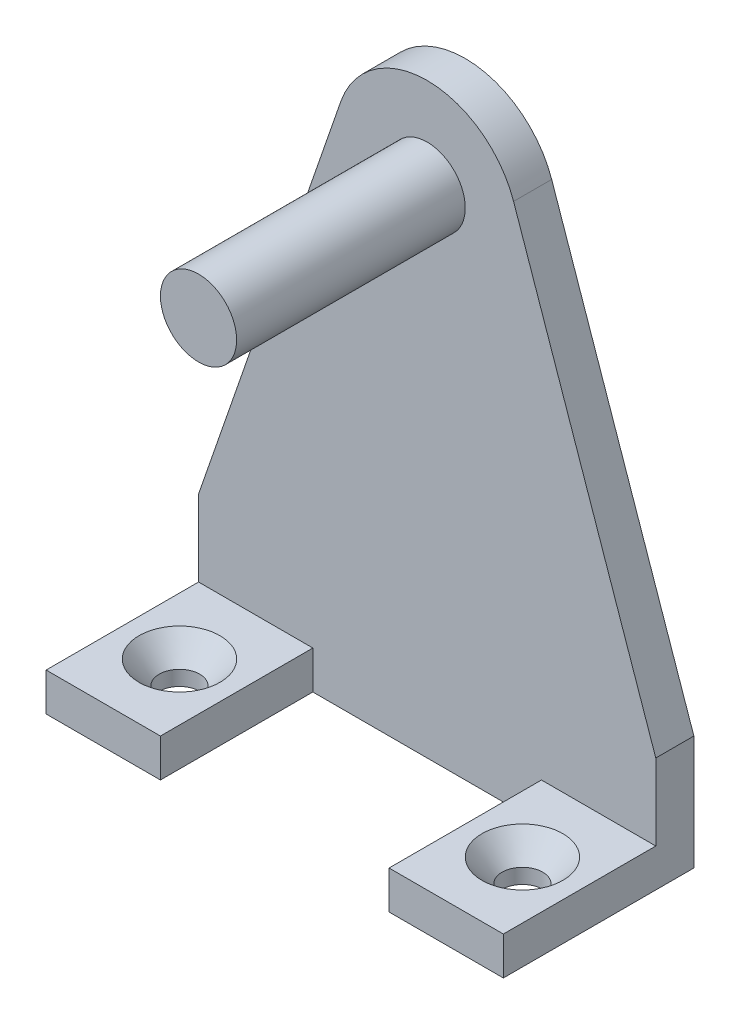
from build123d import *

# Parameters (mm, degrees)
BOSS_EXTRUDE1_DEPTH                          = 6.35
AXLE_DEPTH                                   = 38.1
SKETCH2_W                                    = 19.05
SKETCH2_H                                    = 6.35
FEET_DEPTH                                   = 25.4
CSK_FOR_1_4_FLAT_HEAD_SOCKET_CAP_SCR_2_COUNT = 2
CSK_FOR_1_4_FLAT_HEAD_SOCKET_CAP_SCR_2_PITCH = 57.15


with BuildPart() as part:
    # Sketch1 → Boss-Extrude1 (new body)
    with BuildSketch(Plane.XY):
        with BuildLine():
            ThreePointArc((14.402107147, 87.533664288), (8.840434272, 94.963876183), (0, 97.79))
            Line((0, 97.79), (0, 88.9))
            ThreePointArc((0, 88.9), (4.490128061, 87.040128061), (6.35, 82.55))
            ThreePointArc((6.35, 82.55), (4.490128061, 78.059871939), (0, 76.2))
            Line((0, 76.2), (0, 0))
            Line((0, 0), (38.1, 0))
            Line((38.1, 0), (38.1, 19.05))
            Line((38.1, 19.05), (14.402107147, 87.533664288))
        make_face()
        with BuildLine():
            ThreePointArc((6.35, 82.55), (4.490128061, 87.040128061), (0, 88.9))
            Line((0, 88.9), (0, 76.2))
            ThreePointArc((0, 76.2), (4.490128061, 78.059871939), (6.35, 82.55))
        make_face()
        with BuildLine():
            Line((0, 76.2), (0, 88.9))
            ThreePointArc((0, 88.9), (-6.35, 82.55), (0, 76.2))
        make_face()
        with BuildLine():
            Line((0, 88.9), (0, 97.79))
            ThreePointArc((0, 97.79), (-8.840434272, 94.963876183), (-14.402107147, 87.533664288))
            Line((-14.402107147, 87.533664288), (-38.1, 19.05))
            Line((-38.1, 19.05), (-38.1, 0))
            Line((-38.1, 0), (0, 0))
            Line((0, 0), (0, 76.2))
            ThreePointArc((0, 76.2), (-6.35, 82.55), (0, 88.9))
        make_face()
        with BuildLine():
            ThreePointArc((6.35, 82.55), (4.490128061, 87.040128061), (0, 88.9))
            Line((0, 88.9), (0, 76.2))
            ThreePointArc((0, 76.2), (4.490128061, 78.059871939), (6.35, 82.55))
        make_face()
        with BuildLine():
            Line((0, 76.2), (0, 88.9))
            ThreePointArc((0, 88.9), (-6.35, 82.55), (0, 76.2))
        make_face()
    extrude(amount=-BOSS_EXTRUDE1_DEPTH)

    # Sketch1_3 → Axle (add)
    with BuildSketch(Plane.XY):
        with BuildLine():
            ThreePointArc((6.35, 82.55), (4.490128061, 87.040128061), (0, 88.9))
            Line((0, 88.9), (0, 76.2))
            ThreePointArc((0, 76.2), (4.490128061, 78.059871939), (6.35, 82.55))
        make_face()
        with BuildLine():
            Line((0, 76.2), (0, 88.9))
            ThreePointArc((0, 88.9), (-6.35, 82.55), (0, 76.2))
        make_face()
    extrude(amount=AXLE_DEPTH)

    # Sketch2 → Feet (add)
    with BuildSketch(Plane.XY):
        with Locations((-28.575, 3.175)):
            Rectangle(SKETCH2_W, SKETCH2_H)
        with Locations((28.575, 3.175)):
            Rectangle(SKETCH2_W, SKETCH2_H)
    extrude(amount=FEET_DEPTH)

    # Sketch3 → CSK for 1_4 Flat Head Socket Cap Screw1 (revolve, cut)
    with BuildSketch(Plane(origin=(-28.575, 6.35, 12.7), x_dir=(0, 0, 1), z_dir=(1, 0, 0))):
        Polygon((0, 0), (0, 6.35), (3.3782, 6.35), (3.3782, 3.871564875), (6.7437, 0), align=None)
    csk_for_1_4_flat_head_socket_cap_screw1 = revolve(axis=Axis((-28.575, 12.7, 12.7), (0, -1, 0)), mode=Mode.SUBTRACT)

    # CSK for 1_4 Flat Head Socket Cap Scr 2: CSK for 1_4 Flat Head Socket Cap Screw1 ×2
    with Locations(*[(i * CSK_FOR_1_4_FLAT_HEAD_SOCKET_CAP_SCR_2_PITCH, 0, 0) for i in range(1, CSK_FOR_1_4_FLAT_HEAD_SOCKET_CAP_SCR_2_COUNT)]):
        add(csk_for_1_4_flat_head_socket_cap_screw1, mode=Mode.SUBTRACT)


solid = part.part
